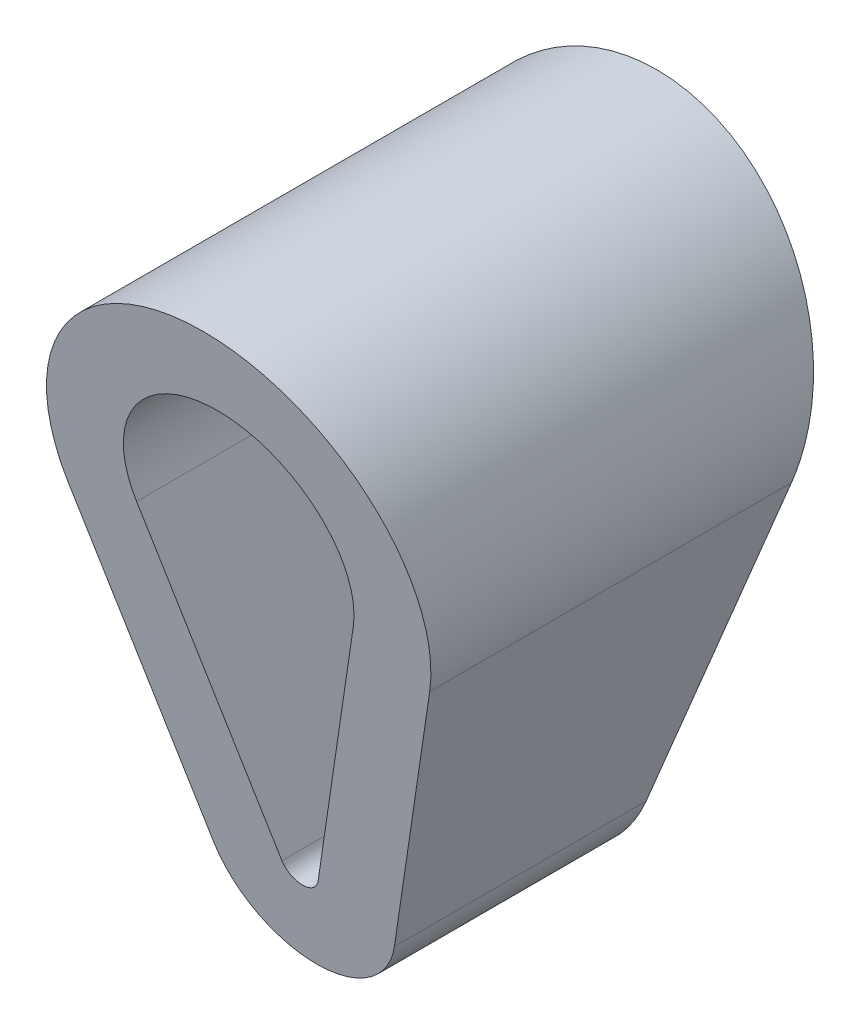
from build123d import *

# Parameters (mm, degrees)
BOSS_EXTRU_1_DEPTH           = 3
ENL_V_MAT_EXTRU_1_DEPTH      = 8.79823698
ENL_V_MAT_EXTRU_1_DEPTH_BACK = 8.79823698


with BuildPart() as part:
    # Esquisse1 → Boss.-Extru.1 (new, symmetric)
    with BuildSketch(Plane.XY):
        with BuildLine():
            Line((2.38942306, 3.514705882), (1.19471153, -0.367647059))
            ThreePointArc((1.19471153, -0.367647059), (0, -1.25), (-1.19471153, -0.367647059))
            Line((-1.19471153, -0.367647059), (-2.38942306, 3.514705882))
            ThreePointArc((-2.38942306, 3.514705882), (0, 6.75), (2.38942306, 3.514705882))
        make_face()
        with BuildLine():
            Line((1.433653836, 3.808823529), (0.238942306, -0.073529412))
            ThreePointArc((0.238942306, -0.073529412), (0, -0.25), (-0.238942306, -0.073529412))
            Line((-0.238942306, -0.073529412), (-1.433653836, 3.808823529))
            ThreePointArc((-1.433653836, 3.808823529), (0, 5.75), (1.433653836, 3.808823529))
        make_face(mode=Mode.SUBTRACT)
    extrude(amount=BOSS_EXTRU_1_DEPTH, both=True)

    # Esquisse2 → Enl_v. mat.-Extru.1 (cut, two sides: drawn at the far end of the back side and taken through both)
    with BuildSketch(Plane(origin=(0, 0, 0), x_dir=(0, 0, -1), z_dir=(1, 0, 0)).offset(-ENL_V_MAT_EXTRU_1_DEPTH_BACK)):
        Polygon((-3, 6.75), (-1.5, -1.25), (-3, -1.25), align=None)
        Polygon((3, 6.75), (3, -1.25), (1.5, -1.25), align=None)
    extrude(amount=ENL_V_MAT_EXTRU_1_DEPTH + ENL_V_MAT_EXTRU_1_DEPTH_BACK, mode=Mode.SUBTRACT)


solid = part.part
